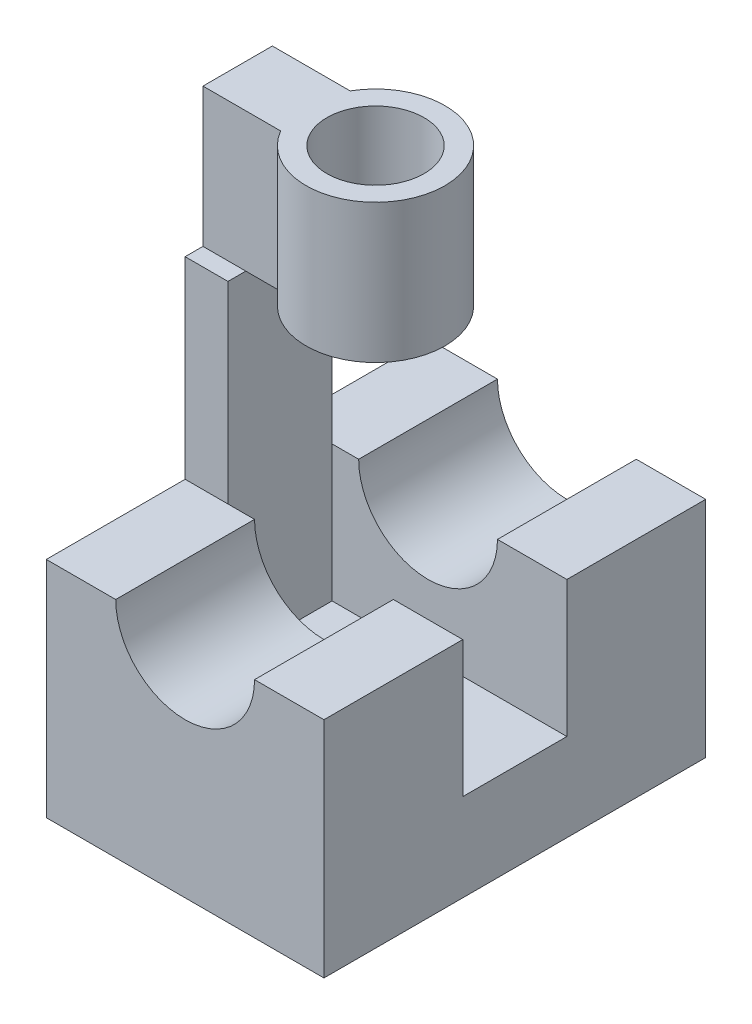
from build123d import *

# Parameters (mm, degrees)
BOSS_EXTRU_1_DEPTH      = 55
ESQUISSE2_W             = 15
ESQUISSE2_H             = 19.596345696
ENL_V_MAT_EXTRU_1_DEPTH = 55
ESQUISSE3_R             = 10
ESQUISSE3_R_2           = 7
BOSS_EXTRU_2_DEPTH      = 20
BOSS_EXTRU_3_DEPTH      = 20
ESQUISSE5_W             = 6.172618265
ESQUISSE5_H             = 15
BOSS_EXTRU_4_DEPTH      = 50


with BuildPart() as part:
    # Esquisse1 → Boss.-Extru.1 (new body)
    with BuildSketch(Plane.XY):
        with BuildLine():
            Line((0, 0), (0, 32.226479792))
            Line((0, 32.226479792), (10, 32.226479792))
            ThreePointArc((10, 32.226479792), (20, 22.226479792), (30, 32.226479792))
            Line((30, 32.226479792), (40, 32.226479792))
            Line((40, 32.226479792), (40, 0))
            Line((40, 0), (0, 0))
        make_face()
    extrude(amount=BOSS_EXTRU_1_DEPTH)

    # Esquisse2 → Enl_v. mat.-Extru.1 (cut)
    with BuildSketch(Plane(origin=(40, 0, 0), x_dir=(0, 0, -1), z_dir=(1, 0, 0))):
        with Locations((-27.5, 22.428306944)):
            Rectangle(ESQUISSE2_W, ESQUISSE2_H)
    extrude(amount=-ENL_V_MAT_EXTRU_1_DEPTH, mode=Mode.SUBTRACT)



with BuildPart() as body_2:
    # Esquisse3 → Boss.-Extru.2 (new body)
    with BuildSketch(Plane(origin=(0, 60, 0), x_dir=(1, 0, 0), z_dir=(0, 1, 0))):
        with Locations(Location((19.860329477, -27.430164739, 0), (0, 0, 270))):
            Circle(ESQUISSE3_R)
        with Locations(Location((19.860329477, -27.430164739, 0), (0, 0, 270))):
            Circle(ESQUISSE3_R_2, mode=Mode.SUBTRACT)
    extrude(amount=BOSS_EXTRU_2_DEPTH)

    # Esquisse4 → Boss.-Extru.3 (add)
    with BuildSketch(Plane(origin=(0, 60, 0), x_dir=(1, 0, 0), z_dir=(0, 1, 0))):
        Polygon((0, -22.430164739), (11.20007544, -22.430164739), (9.895106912, -28.26343493), (11.20007544, -32.430164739), (0, -32.430164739), align=None)
    extrude(amount=BOSS_EXTRU_3_DEPTH)


with BuildPart() as part_1:
    add(part.part)

    add(body_2.part)  # Boss.-Extru.4 merges body 2
    # Esquisse5 → Boss.-Extru.4 (add)
    with BuildSketch(Plane(origin=(0, 60, 0), x_dir=(1, 0, 0), z_dir=(0, 1, 0))):
        with Locations((3.086309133, -27.5)):
            Rectangle(ESQUISSE5_W, ESQUISSE5_H)
    extrude(amount=-BOSS_EXTRU_4_DEPTH)


solid = part_1.part
